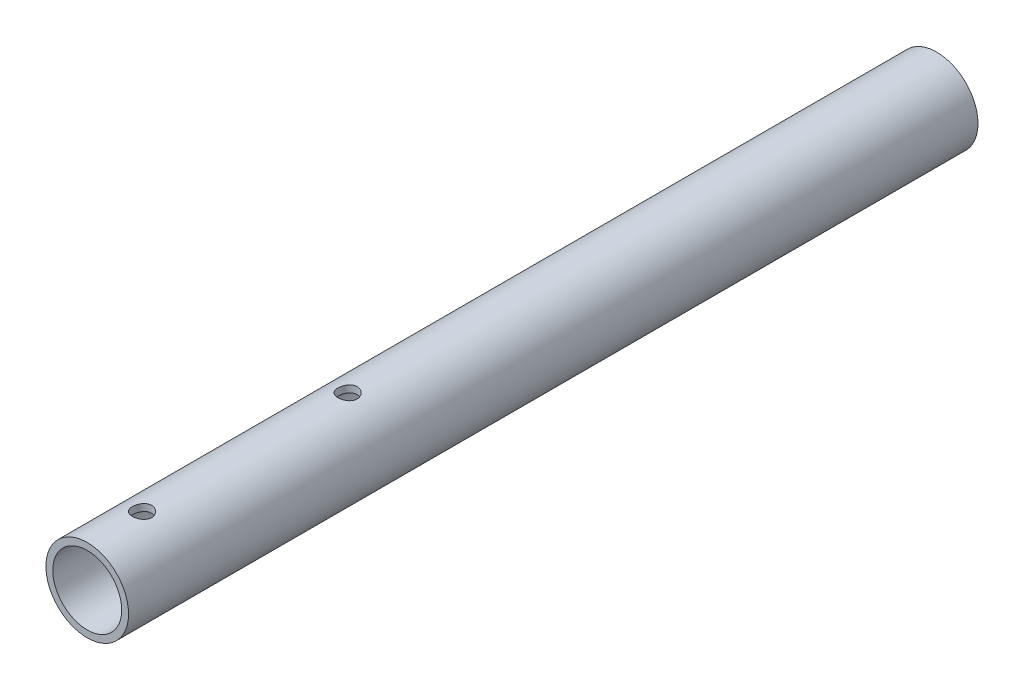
from build123d import *

# Parameters (mm, degrees)
BASEPIPE_START                = -250
SKETCH1_R                     = 30.15
SKETCH1_R_2                   = 25.15
BASEPIPE_DEPTH                = 620
CUT_BORRH_L_REACH             = 374.449
SKETCH2_R                     = 7
CUT_BORRH_L_DIRECTION_2_REACH = 374.449


with BuildPart() as part:
    # Sketch1 → BasePipe (new body)
    with BuildSketch(Plane.XY.offset(BASEPIPE_START)):
        Circle(SKETCH1_R)
        Circle(SKETCH1_R_2, mode=Mode.SUBTRACT)
    extrude(amount=BASEPIPE_DEPTH)

    # Sketch2 → Cut borrh_l (cut, up to next)
    with BuildSketch(Plane(origin=(0, 0, 0), x_dir=(1, 0, 0), z_dir=(0, 1, 0)), mode=Mode.PRIVATE) as cut_borrh_l_sk1:
        with Locations(Location((0, -180, 0), (0, 0, 90))):
            Circle(SKETCH2_R)
    cut_borrh_l_tool1 = extrude(cut_borrh_l_sk1.sketch, amount=-CUT_BORRH_L_REACH, mode=Mode.PRIVATE) & part.part
    # Sketch2 → Cut borrh_l (cut, up to next)
    with BuildSketch(Plane(origin=(0, 0, 0), x_dir=(1, 0, 0), z_dir=(0, 1, 0)), mode=Mode.PRIVATE) as cut_borrh_l_sk2:
        with Locations(Location((0, -330, 0), (0, 0, 90))):
            Circle(SKETCH2_R)
    cut_borrh_l_tool2 = extrude(cut_borrh_l_sk2.sketch, amount=-CUT_BORRH_L_REACH, mode=Mode.PRIVATE) & part.part
    add(cut_borrh_l_tool1.solids().sort_by_distance((0, 0, 180))[0], mode=Mode.SUBTRACT)
    add(cut_borrh_l_tool2.solids().sort_by_distance((0, 0, 330))[0], mode=Mode.SUBTRACT)

    # Sketch2 → Cut borrh_l direction 2 (cut, up to next)
    with BuildSketch(Plane(origin=(0, 0, 0), x_dir=(1, 0, 0), z_dir=(0, 1, 0)), mode=Mode.PRIVATE) as cut_borrh_l_direction_2_sk1:
        with Locations(Location((0, -180, 0), (0, 0, 90))):
            Circle(SKETCH2_R)
    cut_borrh_l_direction_2_tool1 = extrude(cut_borrh_l_direction_2_sk1.sketch, amount=CUT_BORRH_L_DIRECTION_2_REACH, mode=Mode.PRIVATE) & part.part
    # Sketch2 → Cut borrh_l direction 2 (cut, up to next)
    with BuildSketch(Plane(origin=(0, 0, 0), x_dir=(1, 0, 0), z_dir=(0, 1, 0)), mode=Mode.PRIVATE) as cut_borrh_l_direction_2_sk2:
        with Locations(Location((0, -330, 0), (0, 0, 90))):
            Circle(SKETCH2_R)
    cut_borrh_l_direction_2_tool2 = extrude(cut_borrh_l_direction_2_sk2.sketch, amount=CUT_BORRH_L_DIRECTION_2_REACH, mode=Mode.PRIVATE) & part.part
    add(cut_borrh_l_direction_2_tool1.solids().sort_by_distance((0, 0, 180))[0], mode=Mode.SUBTRACT)
    add(cut_borrh_l_direction_2_tool2.solids().sort_by_distance((0, 0, 330))[0], mode=Mode.SUBTRACT)


solid = part.part
